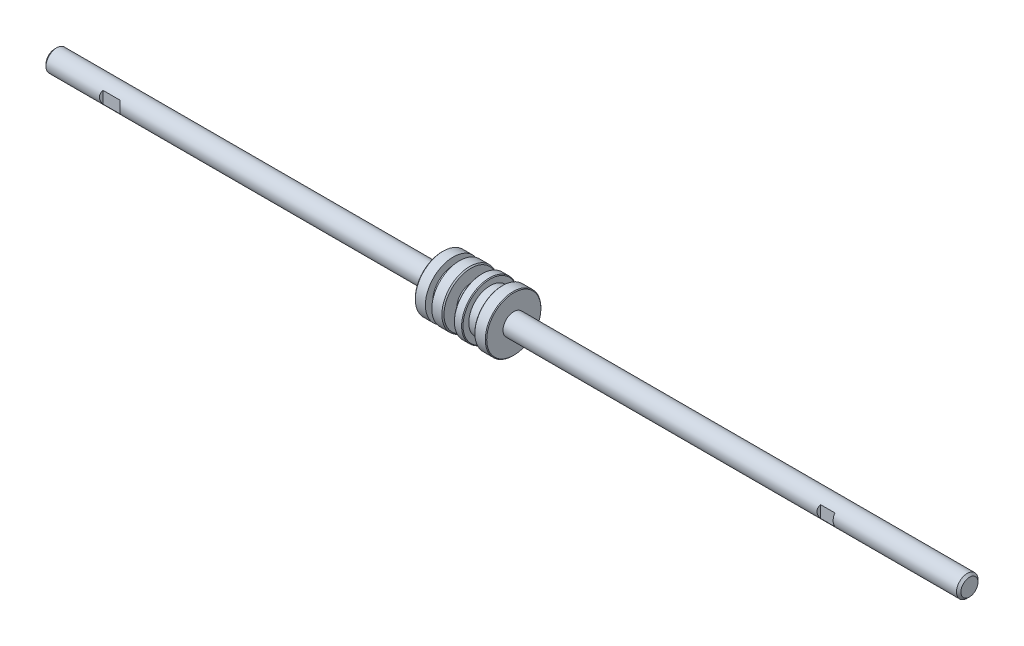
ISO-10303-21;
HEADER;
FILE_DESCRIPTION(('STEP AP214'),'2;1');
FILE_NAME('part.step','',(''),(''),'','','');
FILE_SCHEMA(('AUTOMOTIVE_DESIGN { 1 0 10303 214 1 1 1 1 }'));
ENDSEC;
DATA;
#1=APPLICATION_CONTEXT('core data for automotive mechanical design processes');
#2=APPLICATION_PROTOCOL_DEFINITION('international standard','automotive_design',2000,#1);
#3=PRODUCT_CONTEXT('',#1,'mechanical');
#4=PRODUCT('Part','Part','',(#3));
#5=PRODUCT_RELATED_PRODUCT_CATEGORY('part','',(#4));
#6=PRODUCT_DEFINITION_FORMATION('','',#4);
#7=PRODUCT_DEFINITION_CONTEXT('part definition',#1,'design');
#8=PRODUCT_DEFINITION('design','',#6,#7);
#9=PRODUCT_DEFINITION_SHAPE('','',#8);
#10=(LENGTH_UNIT() NAMED_UNIT(*) SI_UNIT(.MILLI.,.METRE.));
#11=(NAMED_UNIT(*) PLANE_ANGLE_UNIT() SI_UNIT($,.RADIAN.));
#12=(NAMED_UNIT(*) SI_UNIT($,.STERADIAN.) SOLID_ANGLE_UNIT());
#13=UNCERTAINTY_MEASURE_WITH_UNIT(LENGTH_MEASURE(1.E-05),#10,'distance_accuracy_value','');
#14=(GEOMETRIC_REPRESENTATION_CONTEXT(3) GLOBAL_UNCERTAINTY_ASSIGNED_CONTEXT((#13)) GLOBAL_UNIT_ASSIGNED_CONTEXT((#10,
#11,#12)) REPRESENTATION_CONTEXT('',''));
#15=CARTESIAN_POINT('',(0.,0.,0.));
#16=DIRECTION('',(0.,0.,1.));
#17=DIRECTION('',(1.,0.,0.));
#18=AXIS2_PLACEMENT_3D('',#15,#16,#17);
#19=CARTESIAN_POINT('',(0.,0.,0.));
#20=DIRECTION('',(1.,0.,0.));
#21=DIRECTION('',(0.,0.,-1.));
#22=AXIS2_PLACEMENT_3D('',#19,#20,#21);
#23=PLANE('',#22);
#24=CARTESIAN_POINT('',(0.,0.,0.));
#25=DIRECTION('',(1.,0.,0.));
#26=DIRECTION('',(0.,0.,-1.));
#27=AXIS2_PLACEMENT_3D('',#24,#25,#26);
#28=CIRCLE('',#27,2.38649999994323);
#29=CARTESIAN_POINT('',(0.,0.,-2.38649999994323));
#30=VERTEX_POINT('',#29);
#31=EDGE_CURVE('E20',#30,#30,#28,.T.);
#32=ORIENTED_EDGE('',*,*,#31,.F.);
#33=EDGE_LOOP('',(#32));
#34=FACE_BOUND('',#33,.T.);
#35=ADVANCED_FACE('F17',(#34),#23,.F.);
#36=CARTESIAN_POINT('',(20.8,-2.5,-2.5));
#37=DIRECTION('',(0.707106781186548,0.,0.707106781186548));
#38=DIRECTION('',(0.707106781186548,0.,-0.707106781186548));
#39=AXIS2_PLACEMENT_3D('',#36,#37,#38);
#40=PLANE('',#39);
#41=CARTESIAN_POINT('',(18.3,0.,0.));
#42=DIRECTION('',(0.707106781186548,0.,0.707106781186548));
#43=DIRECTION('',(-0.707106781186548,0.,0.707106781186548));
#44=AXIS2_PLACEMENT_3D('',#41,#42,#43);
#45=ELLIPSE('',#44,4.24264068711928,3.);
#46=CARTESIAN_POINT('',(20.8,-1.6583123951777,-2.5));
#47=VERTEX_POINT('',#46);
#48=CARTESIAN_POINT('',(20.8,1.6583123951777,-2.5));
#49=VERTEX_POINT('',#48);
#50=EDGE_CURVE('E105',#47,#49,#45,.T.);
#51=ORIENTED_EDGE('',*,*,#50,.F.);
#52=DIRECTION('',(0.,1.,0.));
#53=VECTOR('',#52,1.);
#54=CARTESIAN_POINT('',(20.8,-2.5,-2.5));
#55=LINE('',#54,#53);
#56=EDGE_CURVE('E116',#47,#49,#55,.T.);
#57=ORIENTED_EDGE('',*,*,#56,.T.);
#58=EDGE_LOOP('',(#51,#57));
#59=FACE_BOUND('',#58,.T.);
#60=ADVANCED_FACE('F368',(#59),#40,.F.);
#61=CARTESIAN_POINT('',(16.,-2.5,-2.5));
#62=DIRECTION('',(0.,0.,1.));
#63=DIRECTION('',(1.,0.,0.));
#64=AXIS2_PLACEMENT_3D('',#61,#62,#63);
#65=PLANE('',#64);
#66=DIRECTION('',(-1.,0.,0.));
#67=VECTOR('',#66,1.);
#68=CARTESIAN_POINT('',(255.,-1.65831239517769,-2.50000000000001));
#69=LINE('',#68,#67);
#70=CARTESIAN_POINT('',(16.,-1.65831239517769,-2.50000000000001));
#71=VERTEX_POINT('',#70);
#72=EDGE_CURVE('E102',#71,#47,#69,.F.);
#73=ORIENTED_EDGE('',*,*,#72,.F.);
#74=DIRECTION('',(0.,1.,0.));
#75=VECTOR('',#74,1.);
#76=CARTESIAN_POINT('',(16.,-2.5,-2.5));
#77=LINE('',#76,#75);
#78=CARTESIAN_POINT('',(16.,1.65831239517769,-2.5));
#79=VERTEX_POINT('',#78);
#80=EDGE_CURVE('E114',#71,#79,#77,.T.);
#81=ORIENTED_EDGE('',*,*,#80,.T.);
#82=DIRECTION('',(-1.,0.,0.));
#83=VECTOR('',#82,1.);
#84=CARTESIAN_POINT('',(255.,1.6583123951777,-2.5));
#85=LINE('',#84,#83);
#86=EDGE_CURVE('E188',#49,#79,#85,.T.);
#87=ORIENTED_EDGE('',*,*,#86,.F.);
#88=ORIENTED_EDGE('',*,*,#56,.F.);
#89=EDGE_LOOP('',(#73,#81,#87,#88));
#90=FACE_BOUND('',#89,.T.);
#91=ADVANCED_FACE('F365',(#90),#65,.F.);
#92=CARTESIAN_POINT('',(14.4,-2.5,-4.1));
#93=DIRECTION('',(-0.707106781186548,0.,0.707106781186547));
#94=DIRECTION('',(0.707106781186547,0.,0.707106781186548));
#95=AXIS2_PLACEMENT_3D('',#92,#93,#94);
#96=PLANE('',#95);
#97=ORIENTED_EDGE('',*,*,#80,.F.);
#98=CARTESIAN_POINT('',(18.5,0.,0.));
#99=DIRECTION('',(-0.707106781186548,0.,0.707106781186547));
#100=DIRECTION('',(-0.707106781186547,0.,-0.707106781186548));
#101=AXIS2_PLACEMENT_3D('',#98,#99,#100);
#102=ELLIPSE('',#101,4.24264068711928,3.);
#103=EDGE_CURVE('E113',#79,#71,#102,.T.);
#104=ORIENTED_EDGE('',*,*,#103,.F.);
#105=EDGE_LOOP('',(#97,#104));
#106=FACE_BOUND('',#105,.T.);
#107=ADVANCED_FACE('F361',(#106),#96,.F.);
#108=CARTESIAN_POINT('',(0.613500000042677,0.,0.));
#109=DIRECTION('',(1.,0.,0.));
#110=DIRECTION('',(0.,0.,-1.));
#111=AXIS2_PLACEMENT_3D('',#108,#109,#110);
#112=CONICAL_SURFACE('',#111,3.00000000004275,0.785398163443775);
#113=CARTESIAN_POINT('',(0.613499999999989,0.,0.));
#114=DIRECTION('',(-1.,0.,0.));
#115=DIRECTION('',(0.,0.,1.));
#116=AXIS2_PLACEMENT_3D('',#113,#114,#115);
#117=CIRCLE('',#116,3.);
#118=CARTESIAN_POINT('',(0.613499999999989,0.,3.));
#119=VERTEX_POINT('',#118);
#120=EDGE_CURVE('E110',#119,#119,#117,.F.);
#121=ORIENTED_EDGE('',*,*,#120,.F.);
#122=EDGE_LOOP('',(#121));
#123=FACE_BOUND('',#122,.T.);
#124=ORIENTED_EDGE('',*,*,#31,.T.);
#125=EDGE_LOOP('',(#124));
#126=FACE_BOUND('',#125,.T.);
#127=ADVANCED_FACE('F358',(#123,#126),#112,.T.);
#128=CARTESIAN_POINT('',(16.,-2.5,2.5));
#129=DIRECTION('',(-0.707106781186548,0.,-0.707106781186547));
#130=DIRECTION('',(-0.707106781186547,0.,0.707106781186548));
#131=AXIS2_PLACEMENT_3D('',#128,#129,#130);
#132=PLANE('',#131);
#133=CARTESIAN_POINT('',(18.5,0.,0.));
#134=DIRECTION('',(-0.707106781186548,0.,-0.707106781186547));
#135=DIRECTION('',(-0.707106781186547,0.,0.707106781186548));
#136=AXIS2_PLACEMENT_3D('',#133,#134,#135);
#137=ELLIPSE('',#136,4.24264068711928,3.);
#138=CARTESIAN_POINT('',(16.,-1.65831239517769,2.5));
#139=VERTEX_POINT('',#138);
#140=CARTESIAN_POINT('',(16.,1.65831239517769,2.5));
#141=VERTEX_POINT('',#140);
#142=EDGE_CURVE('E78',#139,#141,#137,.T.);
#143=ORIENTED_EDGE('',*,*,#142,.F.);
#144=DIRECTION('',(0.,1.,0.));
#145=VECTOR('',#144,1.);
#146=CARTESIAN_POINT('',(16.,-2.5,2.5));
#147=LINE('',#146,#145);
#148=EDGE_CURVE('E99',#139,#141,#147,.T.);
#149=ORIENTED_EDGE('',*,*,#148,.T.);
#150=EDGE_LOOP('',(#143,#149));
#151=FACE_BOUND('',#150,.T.);
#152=ADVANCED_FACE('F355',(#151),#132,.F.);
#153=CARTESIAN_POINT('',(20.8,-2.5,2.5));
#154=DIRECTION('',(0.,0.,-1.));
#155=DIRECTION('',(-1.,0.,0.));
#156=AXIS2_PLACEMENT_3D('',#153,#154,#155);
#157=PLANE('',#156);
#158=DIRECTION('',(-1.,0.,0.));
#159=VECTOR('',#158,1.);
#160=CARTESIAN_POINT('',(255.,1.6583123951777,2.5));
#161=LINE('',#160,#159);
#162=CARTESIAN_POINT('',(20.8,1.65831239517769,2.5));
#163=VERTEX_POINT('',#162);
#164=EDGE_CURVE('E92',#141,#163,#161,.F.);
#165=ORIENTED_EDGE('',*,*,#164,.F.);
#166=ORIENTED_EDGE('',*,*,#148,.F.);
#167=DIRECTION('',(-1.,0.,0.));
#168=VECTOR('',#167,1.);
#169=CARTESIAN_POINT('',(255.,-1.65831239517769,2.50000000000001));
#170=LINE('',#169,#168);
#171=CARTESIAN_POINT('',(20.8,-1.65831239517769,2.5));
#172=VERTEX_POINT('',#171);
#173=EDGE_CURVE('E90',#172,#139,#170,.T.);
#174=ORIENTED_EDGE('',*,*,#173,.F.);
#175=DIRECTION('',(0.,1.,0.));
#176=VECTOR('',#175,1.);
#177=CARTESIAN_POINT('',(20.8,-2.5,2.5));
#178=LINE('',#177,#176);
#179=EDGE_CURVE('E96',#172,#163,#178,.T.);
#180=ORIENTED_EDGE('',*,*,#179,.T.);
#181=EDGE_LOOP('',(#165,#166,#174,#180));
#182=FACE_BOUND('',#181,.T.);
#183=ADVANCED_FACE('F101',(#182),#157,.F.);
#184=CARTESIAN_POINT('',(30.3,-2.5,12.));
#185=DIRECTION('',(0.707106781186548,0.,-0.707106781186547));
#186=DIRECTION('',(-0.707106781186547,0.,-0.707106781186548));
#187=AXIS2_PLACEMENT_3D('',#184,#185,#186);
#188=PLANE('',#187);
#189=ORIENTED_EDGE('',*,*,#179,.F.);
#190=CARTESIAN_POINT('',(18.3,0.,0.));
#191=DIRECTION('',(0.707106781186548,0.,-0.707106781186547));
#192=DIRECTION('',(-0.707106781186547,0.,-0.707106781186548));
#193=AXIS2_PLACEMENT_3D('',#190,#191,#192);
#194=ELLIPSE('',#193,4.24264068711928,3.);
#195=EDGE_CURVE('E85',#163,#172,#194,.T.);
#196=ORIENTED_EDGE('',*,*,#195,.F.);
#197=EDGE_LOOP('',(#189,#196));
#198=FACE_BOUND('',#197,.T.);
#199=ADVANCED_FACE('F97',(#198),#188,.F.);
#200=CARTESIAN_POINT('',(255.,0.,0.));
#201=DIRECTION('',(-1.,0.,0.));
#202=DIRECTION('',(0.,0.,1.));
#203=AXIS2_PLACEMENT_3D('',#200,#201,#202);
#204=CYLINDRICAL_SURFACE('',#203,3.);
#205=ORIENTED_EDGE('',*,*,#72,.T.);
#206=ORIENTED_EDGE('',*,*,#50,.T.);
#207=ORIENTED_EDGE('',*,*,#86,.T.);
#208=ORIENTED_EDGE('',*,*,#103,.T.);
#209=EDGE_LOOP('',(#205,#206,#207,#208));
#210=FACE_BOUND('',#209,.T.);
#211=ORIENTED_EDGE('',*,*,#120,.T.);
#212=EDGE_LOOP('',(#211));
#213=FACE_BOUND('',#212,.T.);
#214=ORIENTED_EDGE('',*,*,#173,.T.);
#215=ORIENTED_EDGE('',*,*,#142,.T.);
#216=ORIENTED_EDGE('',*,*,#164,.T.);
#217=ORIENTED_EDGE('',*,*,#195,.T.);
#218=EDGE_LOOP('',(#214,#215,#216,#217));
#219=FACE_BOUND('',#218,.T.);
#220=CARTESIAN_POINT('',(108.,0.,0.));
#221=DIRECTION('',(-1.,0.,0.));
#222=DIRECTION('',(0.,0.,1.));
#223=AXIS2_PLACEMENT_3D('',#220,#221,#222);
#224=CIRCLE('',#223,3.);
#225=CARTESIAN_POINT('',(108.,0.,3.));
#226=VERTEX_POINT('',#225);
#227=EDGE_CURVE('E94',#226,#226,#224,.T.);
#228=ORIENTED_EDGE('',*,*,#227,.T.);
#229=EDGE_LOOP('',(#228));
#230=FACE_BOUND('',#229,.T.);
#231=ADVANCED_FACE('F87',(#210,#213,#219,#230),#204,.T.);
#232=CARTESIAN_POINT('',(108.,3.,0.));
#233=DIRECTION('',(1.,0.,0.));
#234=DIRECTION('',(0.,0.,-1.));
#235=AXIS2_PLACEMENT_3D('',#232,#233,#234);
#236=PLANE('',#235);
#237=CARTESIAN_POINT('',(108.,0.,0.));
#238=DIRECTION('',(1.,0.,0.));
#239=DIRECTION('',(0.,0.,-1.));
#240=AXIS2_PLACEMENT_3D('',#237,#238,#239);
#241=CIRCLE('',#240,7.45);
#242=CARTESIAN_POINT('',(108.,0.,-7.45));
#243=VERTEX_POINT('',#242);
#244=EDGE_CURVE('E182',#243,#243,#241,.T.);
#245=ORIENTED_EDGE('',*,*,#244,.F.);
#246=EDGE_LOOP('',(#245));
#247=FACE_BOUND('',#246,.T.);
#248=ORIENTED_EDGE('',*,*,#227,.F.);
#249=EDGE_LOOP('',(#248));
#250=FACE_BOUND('',#249,.T.);
#251=ADVANCED_FACE('F344',(#247,#250),#236,.F.);
#252=CARTESIAN_POINT('',(108.3,0.,0.));
#253=DIRECTION('',(1.,0.,0.));
#254=DIRECTION('',(0.,0.,-1.));
#255=AXIS2_PLACEMENT_3D('',#252,#253,#254);
#256=CONICAL_SURFACE('',#255,7.75,0.785398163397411);
#257=CARTESIAN_POINT('',(108.3,0.,0.));
#258=DIRECTION('',(-1.,0.,0.));
#259=DIRECTION('',(0.,0.,1.));
#260=AXIS2_PLACEMENT_3D('',#257,#258,#259);
#261=CIRCLE('',#260,7.75);
#262=CARTESIAN_POINT('',(108.3,0.,7.75));
#263=VERTEX_POINT('',#262);
#264=EDGE_CURVE('E181',#263,#263,#261,.F.);
#265=ORIENTED_EDGE('',*,*,#264,.F.);
#266=EDGE_LOOP('',(#265));
#267=FACE_BOUND('',#266,.T.);
#268=ORIENTED_EDGE('',*,*,#244,.T.);
#269=EDGE_LOOP('',(#268));
#270=FACE_BOUND('',#269,.T.);
#271=ADVANCED_FACE('F340',(#267,#270),#256,.T.);
#272=CARTESIAN_POINT('',(255.,0.,0.));
#273=DIRECTION('',(-1.,0.,0.));
#274=DIRECTION('',(0.,0.,1.));
#275=AXIS2_PLACEMENT_3D('',#272,#273,#274);
#276=CYLINDRICAL_SURFACE('',#275,7.75);
#277=ORIENTED_EDGE('',*,*,#264,.T.);
#278=EDGE_LOOP('',(#277));
#279=FACE_BOUND('',#278,.T.);
#280=CARTESIAN_POINT('',(111.11,0.,0.));
#281=DIRECTION('',(-1.,0.,0.));
#282=DIRECTION('',(0.,0.,1.));
#283=AXIS2_PLACEMENT_3D('',#280,#281,#282);
#284=CIRCLE('',#283,7.75);
#285=CARTESIAN_POINT('',(111.11,0.,7.75));
#286=VERTEX_POINT('',#285);
#287=EDGE_CURVE('E178',#286,#286,#284,.T.);
#288=ORIENTED_EDGE('',*,*,#287,.T.);
#289=EDGE_LOOP('',(#288));
#290=FACE_BOUND('',#289,.T.);
#291=ADVANCED_FACE('F336',(#279,#290),#276,.T.);
#292=CARTESIAN_POINT('',(111.11,7.75,0.));
#293=DIRECTION('',(-1.,0.,0.));
#294=DIRECTION('',(0.,0.,1.));
#295=AXIS2_PLACEMENT_3D('',#292,#293,#294);
#296=PLANE('',#295);
#297=CARTESIAN_POINT('',(111.11,0.,0.));
#298=DIRECTION('',(-1.,0.,0.));
#299=DIRECTION('',(0.,0.,1.));
#300=AXIS2_PLACEMENT_3D('',#297,#298,#299);
#301=CIRCLE('',#300,5.7);
#302=CARTESIAN_POINT('',(111.11,0.,5.7));
#303=VERTEX_POINT('',#302);
#304=EDGE_CURVE('E175',#303,#303,#301,.F.);
#305=ORIENTED_EDGE('',*,*,#304,.F.);
#306=EDGE_LOOP('',(#305));
#307=FACE_BOUND('',#306,.T.);
#308=ORIENTED_EDGE('',*,*,#287,.F.);
#309=EDGE_LOOP('',(#308));
#310=FACE_BOUND('',#309,.T.);
#311=ADVANCED_FACE('F332',(#307,#310),#296,.F.);
#312=CARTESIAN_POINT('',(255.,0.,0.));
#313=DIRECTION('',(-1.,0.,0.));
#314=DIRECTION('',(0.,0.,1.));
#315=AXIS2_PLACEMENT_3D('',#312,#313,#314);
#316=CYLINDRICAL_SURFACE('',#315,5.7);
#317=ORIENTED_EDGE('',*,*,#304,.T.);
#318=EDGE_LOOP('',(#317));
#319=FACE_BOUND('',#318,.T.);
#320=CARTESIAN_POINT('',(112.89,0.,0.));
#321=DIRECTION('',(-1.,0.,0.));
#322=DIRECTION('',(0.,0.,1.));
#323=AXIS2_PLACEMENT_3D('',#320,#321,#322);
#324=CIRCLE('',#323,5.7);
#325=CARTESIAN_POINT('',(112.89,0.,5.7));
#326=VERTEX_POINT('',#325);
#327=EDGE_CURVE('E172',#326,#326,#324,.T.);
#328=ORIENTED_EDGE('',*,*,#327,.T.);
#329=EDGE_LOOP('',(#328));
#330=FACE_BOUND('',#329,.T.);
#331=ADVANCED_FACE('F328',(#319,#330),#316,.T.);
#332=CARTESIAN_POINT('',(112.89,5.7,0.));
#333=DIRECTION('',(1.,0.,0.));
#334=DIRECTION('',(0.,0.,-1.));
#335=AXIS2_PLACEMENT_3D('',#332,#333,#334);
#336=PLANE('',#335);
#337=CARTESIAN_POINT('',(112.89,0.,0.));
#338=DIRECTION('',(-1.,0.,0.));
#339=DIRECTION('',(0.,0.,1.));
#340=AXIS2_PLACEMENT_3D('',#337,#338,#339);
#341=CIRCLE('',#340,7.75);
#342=CARTESIAN_POINT('',(112.89,0.,7.75));
#343=VERTEX_POINT('',#342);
#344=EDGE_CURVE('E169',#343,#343,#341,.F.);
#345=ORIENTED_EDGE('',*,*,#344,.F.);
#346=EDGE_LOOP('',(#345));
#347=FACE_BOUND('',#346,.T.);
#348=ORIENTED_EDGE('',*,*,#327,.F.);
#349=EDGE_LOOP('',(#348));
#350=FACE_BOUND('',#349,.T.);
#351=ADVANCED_FACE('F324',(#347,#350),#336,.F.);
#352=CARTESIAN_POINT('',(255.,0.,0.));
#353=DIRECTION('',(-1.,0.,0.));
#354=DIRECTION('',(0.,0.,1.));
#355=AXIS2_PLACEMENT_3D('',#352,#353,#354);
#356=CYLINDRICAL_SURFACE('',#355,7.75);
#357=ORIENTED_EDGE('',*,*,#344,.T.);
#358=EDGE_LOOP('',(#357));
#359=FACE_BOUND('',#358,.T.);
#360=CARTESIAN_POINT('',(115.7,0.,0.));
#361=DIRECTION('',(-1.,0.,0.));
#362=DIRECTION('',(0.,0.,1.));
#363=AXIS2_PLACEMENT_3D('',#360,#361,#362);
#364=CIRCLE('',#363,7.74999999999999);
#365=CARTESIAN_POINT('',(115.7,0.,7.74999999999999));
#366=VERTEX_POINT('',#365);
#367=EDGE_CURVE('E168',#366,#366,#364,.F.);
#368=ORIENTED_EDGE('',*,*,#367,.F.);
#369=EDGE_LOOP('',(#368));
#370=FACE_BOUND('',#369,.T.);
#371=ADVANCED_FACE('F320',(#359,#370),#356,.T.);
#372=CARTESIAN_POINT('',(115.7,0.,0.));
#373=DIRECTION('',(-1.,0.,0.));
#374=DIRECTION('',(0.,0.,1.));
#375=AXIS2_PLACEMENT_3D('',#372,#373,#374);
#376=CONICAL_SURFACE('',#375,7.74999999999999,0.785398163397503);
#377=ORIENTED_EDGE('',*,*,#367,.T.);
#378=EDGE_LOOP('',(#377));
#379=FACE_BOUND('',#378,.T.);
#380=CARTESIAN_POINT('',(116.,0.,0.));
#381=DIRECTION('',(-1.,0.,0.));
#382=DIRECTION('',(0.,0.,1.));
#383=AXIS2_PLACEMENT_3D('',#380,#381,#382);
#384=CIRCLE('',#383,7.45);
#385=CARTESIAN_POINT('',(116.,0.,7.45));
#386=VERTEX_POINT('',#385);
#387=EDGE_CURVE('E165',#386,#386,#384,.T.);
#388=ORIENTED_EDGE('',*,*,#387,.T.);
#389=EDGE_LOOP('',(#388));
#390=FACE_BOUND('',#389,.T.);
#391=ADVANCED_FACE('F316',(#379,#390),#376,.T.);
#392=CARTESIAN_POINT('',(116.,7.45,0.));
#393=DIRECTION('',(-1.,0.,0.));
#394=DIRECTION('',(0.,0.,1.));
#395=AXIS2_PLACEMENT_3D('',#392,#393,#394);
#396=PLANE('',#395);
#397=CARTESIAN_POINT('',(116.,0.,0.));
#398=DIRECTION('',(-1.,0.,0.));
#399=DIRECTION('',(0.,0.,1.));
#400=AXIS2_PLACEMENT_3D('',#397,#398,#399);
#401=CIRCLE('',#400,3.85);
#402=CARTESIAN_POINT('',(116.,0.,3.85));
#403=VERTEX_POINT('',#402);
#404=EDGE_CURVE('E162',#403,#403,#401,.F.);
#405=ORIENTED_EDGE('',*,*,#404,.F.);
#406=EDGE_LOOP('',(#405));
#407=FACE_BOUND('',#406,.T.);
#408=ORIENTED_EDGE('',*,*,#387,.F.);
#409=EDGE_LOOP('',(#408));
#410=FACE_BOUND('',#409,.T.);
#411=ADVANCED_FACE('F312',(#407,#410),#396,.F.);
#412=CARTESIAN_POINT('',(255.,0.,0.));
#413=DIRECTION('',(-1.,0.,0.));
#414=DIRECTION('',(0.,0.,1.));
#415=AXIS2_PLACEMENT_3D('',#412,#413,#414);
#416=CYLINDRICAL_SURFACE('',#415,3.85);
#417=ORIENTED_EDGE('',*,*,#404,.T.);
#418=EDGE_LOOP('',(#417));
#419=FACE_BOUND('',#418,.T.);
#420=CARTESIAN_POINT('',(119.,0.,0.));
#421=DIRECTION('',(-1.,0.,0.));
#422=DIRECTION('',(0.,0.,1.));
#423=AXIS2_PLACEMENT_3D('',#420,#421,#422);
#424=CIRCLE('',#423,3.85);
#425=CARTESIAN_POINT('',(119.,0.,3.85));
#426=VERTEX_POINT('',#425);
#427=EDGE_CURVE('E159',#426,#426,#424,.T.);
#428=ORIENTED_EDGE('',*,*,#427,.T.);
#429=EDGE_LOOP('',(#428));
#430=FACE_BOUND('',#429,.T.);
#431=ADVANCED_FACE('F308',(#419,#430),#416,.T.);
#432=CARTESIAN_POINT('',(119.,3.85,0.));
#433=DIRECTION('',(1.,0.,0.));
#434=DIRECTION('',(0.,0.,-1.));
#435=AXIS2_PLACEMENT_3D('',#432,#433,#434);
#436=PLANE('',#435);
#437=CARTESIAN_POINT('',(119.,0.,0.));
#438=DIRECTION('',(1.,0.,0.));
#439=DIRECTION('',(0.,1.,0.));
#440=AXIS2_PLACEMENT_3D('',#437,#438,#439);
#441=CIRCLE('',#440,7.55);
#442=CARTESIAN_POINT('',(119.,7.55,0.));
#443=VERTEX_POINT('',#442);
#444=EDGE_CURVE('E155',#443,#443,#441,.T.);
#445=ORIENTED_EDGE('',*,*,#444,.F.);
#446=EDGE_LOOP('',(#445));
#447=FACE_BOUND('',#446,.T.);
#448=ORIENTED_EDGE('',*,*,#427,.F.);
#449=EDGE_LOOP('',(#448));
#450=FACE_BOUND('',#449,.T.);
#451=ADVANCED_FACE('F304',(#447,#450),#436,.F.);
#452=CARTESIAN_POINT('',(119.2,0.,0.));
#453=DIRECTION('',(1.,0.,0.));
#454=DIRECTION('',(0.,1.,0.));
#455=AXIS2_PLACEMENT_3D('',#452,#453,#454);
#456=CONICAL_SURFACE('',#455,7.75,0.785398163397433);
#457=CARTESIAN_POINT('',(119.2,0.,0.));
#458=DIRECTION('',(-1.,0.,0.));
#459=DIRECTION('',(0.,0.,1.));
#460=AXIS2_PLACEMENT_3D('',#457,#458,#459);
#461=CIRCLE('',#460,7.75);
#462=CARTESIAN_POINT('',(119.2,0.,7.75));
#463=VERTEX_POINT('',#462);
#464=EDGE_CURVE('E158',#463,#463,#461,.F.);
#465=ORIENTED_EDGE('',*,*,#464,.F.);
#466=EDGE_LOOP('',(#465));
#467=FACE_BOUND('',#466,.T.);
#468=ORIENTED_EDGE('',*,*,#444,.T.);
#469=EDGE_LOOP('',(#468));
#470=FACE_BOUND('',#469,.T.);
#471=ADVANCED_FACE('F300',(#467,#470),#456,.T.);
#472=CARTESIAN_POINT('',(255.,0.,0.));
#473=DIRECTION('',(-1.,0.,0.));
#474=DIRECTION('',(0.,0.,1.));
#475=AXIS2_PLACEMENT_3D('',#472,#473,#474);
#476=CYLINDRICAL_SURFACE('',#475,7.75);
#477=ORIENTED_EDGE('',*,*,#464,.T.);
#478=EDGE_LOOP('',(#477));
#479=FACE_BOUND('',#478,.T.);
#480=CARTESIAN_POINT('',(121.2,0.,0.));
#481=DIRECTION('',(-1.,0.,0.));
#482=DIRECTION('',(0.,0.,1.));
#483=AXIS2_PLACEMENT_3D('',#480,#481,#482);
#484=CIRCLE('',#483,7.75);
#485=CARTESIAN_POINT('',(121.2,0.,7.75));
#486=VERTEX_POINT('',#485);
#487=EDGE_CURVE('E154',#486,#486,#484,.F.);
#488=ORIENTED_EDGE('',*,*,#487,.F.);
#489=EDGE_LOOP('',(#488));
#490=FACE_BOUND('',#489,.T.);
#491=ADVANCED_FACE('F296',(#479,#490),#476,.T.);
#492=CARTESIAN_POINT('',(121.2,0.,0.));
#493=DIRECTION('',(-1.,0.,0.));
#494=DIRECTION('',(0.,0.,1.));
#495=AXIS2_PLACEMENT_3D('',#492,#493,#494);
#496=CONICAL_SURFACE('',#495,7.75,0.785398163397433);
#497=ORIENTED_EDGE('',*,*,#487,.T.);
#498=EDGE_LOOP('',(#497));
#499=FACE_BOUND('',#498,.T.);
#500=CARTESIAN_POINT('',(121.4,0.,0.));
#501=DIRECTION('',(-1.,0.,0.));
#502=DIRECTION('',(0.,0.,1.));
#503=AXIS2_PLACEMENT_3D('',#500,#501,#502);
#504=CIRCLE('',#503,7.55);
#505=CARTESIAN_POINT('',(121.4,0.,7.55));
#506=VERTEX_POINT('',#505);
#507=EDGE_CURVE('E151',#506,#506,#504,.T.);
#508=ORIENTED_EDGE('',*,*,#507,.T.);
#509=EDGE_LOOP('',(#508));
#510=FACE_BOUND('',#509,.T.);
#511=ADVANCED_FACE('F292',(#499,#510),#496,.T.);
#512=CARTESIAN_POINT('',(121.4,7.55,0.));
#513=DIRECTION('',(-1.,0.,0.));
#514=DIRECTION('',(0.,0.,1.));
#515=AXIS2_PLACEMENT_3D('',#512,#513,#514);
#516=PLANE('',#515);
#517=CARTESIAN_POINT('',(121.4,0.,0.));
#518=DIRECTION('',(-1.,0.,0.));
#519=DIRECTION('',(0.,0.,1.));
#520=AXIS2_PLACEMENT_3D('',#517,#518,#519);
#521=CIRCLE('',#520,5.95);
#522=CARTESIAN_POINT('',(121.4,0.,5.95));
#523=VERTEX_POINT('',#522);
#524=EDGE_CURVE('E148',#523,#523,#521,.F.);
#525=ORIENTED_EDGE('',*,*,#524,.F.);
#526=EDGE_LOOP('',(#525));
#527=FACE_BOUND('',#526,.T.);
#528=ORIENTED_EDGE('',*,*,#507,.F.);
#529=EDGE_LOOP('',(#528));
#530=FACE_BOUND('',#529,.T.);
#531=ADVANCED_FACE('F288',(#527,#530),#516,.F.);
#532=CARTESIAN_POINT('',(255.,0.,0.));
#533=DIRECTION('',(-1.,0.,0.));
#534=DIRECTION('',(0.,0.,1.));
#535=AXIS2_PLACEMENT_3D('',#532,#533,#534);
#536=CYLINDRICAL_SURFACE('',#535,5.95);
#537=ORIENTED_EDGE('',*,*,#524,.T.);
#538=EDGE_LOOP('',(#537));
#539=FACE_BOUND('',#538,.T.);
#540=CARTESIAN_POINT('',(124.7,0.,0.));
#541=DIRECTION('',(-1.,0.,0.));
#542=DIRECTION('',(0.,0.,1.));
#543=AXIS2_PLACEMENT_3D('',#540,#541,#542);
#544=CIRCLE('',#543,5.95);
#545=CARTESIAN_POINT('',(124.7,0.,5.95));
#546=VERTEX_POINT('',#545);
#547=EDGE_CURVE('E145',#546,#546,#544,.T.);
#548=ORIENTED_EDGE('',*,*,#547,.T.);
#549=EDGE_LOOP('',(#548));
#550=FACE_BOUND('',#549,.T.);
#551=ADVANCED_FACE('F284',(#539,#550),#536,.T.);
#552=CARTESIAN_POINT('',(124.7,5.95,0.));
#553=DIRECTION('',(1.,0.,0.));
#554=DIRECTION('',(0.,0.,-1.));
#555=AXIS2_PLACEMENT_3D('',#552,#553,#554);
#556=PLANE('',#555);
#557=CARTESIAN_POINT('',(124.7,0.,0.));
#558=DIRECTION('',(1.,0.,0.));
#559=DIRECTION('',(0.,0.,-1.));
#560=AXIS2_PLACEMENT_3D('',#557,#558,#559);
#561=CIRCLE('',#560,7.55);
#562=CARTESIAN_POINT('',(124.7,0.,-7.55));
#563=VERTEX_POINT('',#562);
#564=EDGE_CURVE('E141',#563,#563,#561,.T.);
#565=ORIENTED_EDGE('',*,*,#564,.F.);
#566=EDGE_LOOP('',(#565));
#567=FACE_BOUND('',#566,.T.);
#568=ORIENTED_EDGE('',*,*,#547,.F.);
#569=EDGE_LOOP('',(#568));
#570=FACE_BOUND('',#569,.T.);
#571=ADVANCED_FACE('F280',(#567,#570),#556,.F.);
#572=CARTESIAN_POINT('',(124.9,0.,0.));
#573=DIRECTION('',(1.,0.,0.));
#574=DIRECTION('',(0.,0.,-1.));
#575=AXIS2_PLACEMENT_3D('',#572,#573,#574);
#576=CONICAL_SURFACE('',#575,7.75,0.785398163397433);
#577=CARTESIAN_POINT('',(124.9,0.,0.));
#578=DIRECTION('',(-1.,0.,0.));
#579=DIRECTION('',(0.,0.,1.));
#580=AXIS2_PLACEMENT_3D('',#577,#578,#579);
#581=CIRCLE('',#580,7.75);
#582=CARTESIAN_POINT('',(124.9,0.,7.75));
#583=VERTEX_POINT('',#582);
#584=EDGE_CURVE('E144',#583,#583,#581,.F.);
#585=ORIENTED_EDGE('',*,*,#584,.F.);
#586=EDGE_LOOP('',(#585));
#587=FACE_BOUND('',#586,.T.);
#588=ORIENTED_EDGE('',*,*,#564,.T.);
#589=EDGE_LOOP('',(#588));
#590=FACE_BOUND('',#589,.T.);
#591=ADVANCED_FACE('F276',(#587,#590),#576,.T.);
#592=CARTESIAN_POINT('',(255.,0.,0.));
#593=DIRECTION('',(-1.,0.,0.));
#594=DIRECTION('',(0.,0.,1.));
#595=AXIS2_PLACEMENT_3D('',#592,#593,#594);
#596=CYLINDRICAL_SURFACE('',#595,7.75);
#597=ORIENTED_EDGE('',*,*,#584,.T.);
#598=EDGE_LOOP('',(#597));
#599=FACE_BOUND('',#598,.T.);
#600=CARTESIAN_POINT('',(127.8,0.,0.));
#601=DIRECTION('',(-1.,0.,0.));
#602=DIRECTION('',(0.,0.,1.));
#603=AXIS2_PLACEMENT_3D('',#600,#601,#602);
#604=CIRCLE('',#603,7.75);
#605=CARTESIAN_POINT('',(127.8,0.,7.75));
#606=VERTEX_POINT('',#605);
#607=EDGE_CURVE('E140',#606,#606,#604,.F.);
#608=ORIENTED_EDGE('',*,*,#607,.F.);
#609=EDGE_LOOP('',(#608));
#610=FACE_BOUND('',#609,.T.);
#611=ADVANCED_FACE('F269',(#599,#610),#596,.T.);
#612=CARTESIAN_POINT('',(255.,2.3865,0.));
#613=DIRECTION('',(-1.,0.,0.));
#614=DIRECTION('',(0.,0.,1.));
#615=AXIS2_PLACEMENT_3D('',#612,#613,#614);
#616=PLANE('',#615);
#617=CARTESIAN_POINT('',(255.000000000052,0.,0.));
#618=DIRECTION('',(-1.,0.,0.));
#619=DIRECTION('',(0.,0.,1.));
#620=AXIS2_PLACEMENT_3D('',#617,#618,#619);
#621=CIRCLE('',#620,2.38649999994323);
#622=CARTESIAN_POINT('',(255.000000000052,0.,2.38649999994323));
#623=VERTEX_POINT('',#622);
#624=EDGE_CURVE('E136',#623,#623,#621,.T.);
#625=ORIENTED_EDGE('',*,*,#624,.F.);
#626=EDGE_LOOP('',(#625));
#627=FACE_BOUND('',#626,.T.);
#628=ADVANCED_FACE('F259',(#627),#616,.F.);
#629=CARTESIAN_POINT('',(127.8,0.,0.));
#630=DIRECTION('',(-1.,0.,0.));
#631=DIRECTION('',(0.,0.,1.));
#632=AXIS2_PLACEMENT_3D('',#629,#630,#631);
#633=CONICAL_SURFACE('',#632,7.75,0.785398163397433);
#634=ORIENTED_EDGE('',*,*,#607,.T.);
#635=EDGE_LOOP('',(#634));
#636=FACE_BOUND('',#635,.T.);
#637=CARTESIAN_POINT('',(128.,0.,0.));
#638=DIRECTION('',(-1.,0.,0.));
#639=DIRECTION('',(0.,0.,1.));
#640=AXIS2_PLACEMENT_3D('',#637,#638,#639);
#641=CIRCLE('',#640,7.55);
#642=CARTESIAN_POINT('',(128.,0.,7.55));
#643=VERTEX_POINT('',#642);
#644=EDGE_CURVE('E131',#643,#643,#641,.T.);
#645=ORIENTED_EDGE('',*,*,#644,.T.);
#646=EDGE_LOOP('',(#645));
#647=FACE_BOUND('',#646,.T.);
#648=ADVANCED_FACE('F256',(#636,#647),#633,.T.);
#649=CARTESIAN_POINT('',(254.38650000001,0.,0.));
#650=DIRECTION('',(-1.,0.,0.));
#651=DIRECTION('',(0.,0.,1.));
#652=AXIS2_PLACEMENT_3D('',#649,#650,#651);
#653=CONICAL_SURFACE('',#652,2.9999999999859,0.785398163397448);
#654=CARTESIAN_POINT('',(254.3865,0.,0.));
#655=DIRECTION('',(-1.,0.,0.));
#656=DIRECTION('',(0.,0.,1.));
#657=AXIS2_PLACEMENT_3D('',#654,#655,#656);
#658=CIRCLE('',#657,3.);
#659=CARTESIAN_POINT('',(254.3865,0.,3.));
#660=VERTEX_POINT('',#659);
#661=EDGE_CURVE('E130',#660,#660,#658,.T.);
#662=ORIENTED_EDGE('',*,*,#661,.F.);
#663=EDGE_LOOP('',(#662));
#664=FACE_BOUND('',#663,.T.);
#665=ORIENTED_EDGE('',*,*,#624,.T.);
#666=EDGE_LOOP('',(#665));
#667=FACE_BOUND('',#666,.T.);
#668=ADVANCED_FACE('F258',(#664,#667),#653,.T.);
#669=CARTESIAN_POINT('',(220.,-2.5,-2.5));
#670=DIRECTION('',(1.,0.,0.));
#671=DIRECTION('',(0.,0.,-1.));
#672=AXIS2_PLACEMENT_3D('',#669,#670,#671);
#673=PLANE('',#672);
#674=CARTESIAN_POINT('',(220.,0.,0.));
#675=DIRECTION('',(-1.,0.,0.));
#676=DIRECTION('',(0.,0.,1.));
#677=AXIS2_PLACEMENT_3D('',#674,#675,#676);
#678=CIRCLE('',#677,3.);
#679=CARTESIAN_POINT('',(220.,-1.6583123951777,-2.5));
#680=VERTEX_POINT('',#679);
#681=CARTESIAN_POINT('',(220.,1.6583123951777,-2.5));
#682=VERTEX_POINT('',#681);
#683=EDGE_CURVE('E127',#680,#682,#678,.F.);
#684=ORIENTED_EDGE('',*,*,#683,.F.);
#685=DIRECTION('',(0.,1.,0.));
#686=VECTOR('',#685,1.);
#687=CARTESIAN_POINT('',(220.,-2.5,-2.5));
#688=LINE('',#687,#686);
#689=EDGE_CURVE('E139',#680,#682,#688,.T.);
#690=ORIENTED_EDGE('',*,*,#689,.T.);
#691=EDGE_LOOP('',(#684,#690));
#692=FACE_BOUND('',#691,.T.);
#693=ADVANCED_FACE('F266',(#692),#673,.F.);
#694=CARTESIAN_POINT('',(216.,-2.5,-2.5));
#695=DIRECTION('',(0.,0.,1.));
#696=DIRECTION('',(1.,0.,0.));
#697=AXIS2_PLACEMENT_3D('',#694,#695,#696);
#698=PLANE('',#697);
#699=DIRECTION('',(-1.,0.,0.));
#700=VECTOR('',#699,1.);
#701=CARTESIAN_POINT('',(255.,-1.6583123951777,-2.5));
#702=LINE('',#701,#700);
#703=CARTESIAN_POINT('',(216.,-1.65831239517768,-2.50000000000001));
#704=VERTEX_POINT('',#703);
#705=EDGE_CURVE('E209',#704,#680,#702,.F.);
#706=ORIENTED_EDGE('',*,*,#705,.F.);
#707=DIRECTION('',(0.,1.,0.));
#708=VECTOR('',#707,1.);
#709=CARTESIAN_POINT('',(216.,-2.5,-2.50000000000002));
#710=LINE('',#709,#708);
#711=CARTESIAN_POINT('',(216.,1.65831239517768,-2.50000000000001));
#712=VERTEX_POINT('',#711);
#713=EDGE_CURVE('E135',#704,#712,#710,.T.);
#714=ORIENTED_EDGE('',*,*,#713,.T.);
#715=DIRECTION('',(-1.,0.,0.));
#716=VECTOR('',#715,1.);
#717=CARTESIAN_POINT('',(255.,1.6583123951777,-2.5));
#718=LINE('',#717,#716);
#719=EDGE_CURVE('E126',#682,#712,#718,.T.);
#720=ORIENTED_EDGE('',*,*,#719,.F.);
#721=ORIENTED_EDGE('',*,*,#689,.F.);
#722=EDGE_LOOP('',(#706,#714,#720,#721));
#723=FACE_BOUND('',#722,.T.);
#724=ADVANCED_FACE('F579',(#723),#698,.F.);
#725=CARTESIAN_POINT('',(206.5,-2.5,-12.));
#726=DIRECTION('',(-0.707106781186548,0.,0.707106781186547));
#727=DIRECTION('',(0.707106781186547,0.,0.707106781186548));
#728=AXIS2_PLACEMENT_3D('',#725,#726,#727);
#729=PLANE('',#728);
#730=ORIENTED_EDGE('',*,*,#713,.F.);
#731=CARTESIAN_POINT('',(218.5,0.,0.));
#732=DIRECTION('',(-0.707106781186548,0.,0.707106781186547));
#733=DIRECTION('',(-0.707106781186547,0.,-0.707106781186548));
#734=AXIS2_PLACEMENT_3D('',#731,#732,#733);
#735=ELLIPSE('',#734,4.24264068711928,3.);
#736=EDGE_CURVE('E124',#712,#704,#735,.T.);
#737=ORIENTED_EDGE('',*,*,#736,.F.);
#738=EDGE_LOOP('',(#730,#737));
#739=FACE_BOUND('',#738,.T.);
#740=ADVANCED_FACE('F239',(#739),#729,.F.);
#741=CARTESIAN_POINT('',(128.,7.55,0.));
#742=DIRECTION('',(-1.,0.,0.));
#743=DIRECTION('',(0.,0.,1.));
#744=AXIS2_PLACEMENT_3D('',#741,#742,#743);
#745=PLANE('',#744);
#746=CARTESIAN_POINT('',(128.,0.,0.));
#747=DIRECTION('',(-1.,0.,0.));
#748=DIRECTION('',(0.,0.,1.));
#749=AXIS2_PLACEMENT_3D('',#746,#747,#748);
#750=CIRCLE('',#749,3.);
#751=CARTESIAN_POINT('',(128.,0.,3.));
#752=VERTEX_POINT('',#751);
#753=EDGE_CURVE('E121',#752,#752,#750,.F.);
#754=ORIENTED_EDGE('',*,*,#753,.F.);
#755=EDGE_LOOP('',(#754));
#756=FACE_BOUND('',#755,.T.);
#757=ORIENTED_EDGE('',*,*,#644,.F.);
#758=EDGE_LOOP('',(#757));
#759=FACE_BOUND('',#758,.T.);
#760=ADVANCED_FACE('F230',(#756,#759),#745,.F.);
#761=CARTESIAN_POINT('',(216.,-2.5,2.5));
#762=DIRECTION('',(-0.707106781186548,0.,-0.707106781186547));
#763=DIRECTION('',(-0.707106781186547,0.,0.707106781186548));
#764=AXIS2_PLACEMENT_3D('',#761,#762,#763);
#765=PLANE('',#764);
#766=CARTESIAN_POINT('',(218.5,0.,0.));
#767=DIRECTION('',(-0.707106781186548,0.,-0.707106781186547));
#768=DIRECTION('',(-0.707106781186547,0.,0.707106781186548));
#769=AXIS2_PLACEMENT_3D('',#766,#767,#768);
#770=ELLIPSE('',#769,4.24264068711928,3.);
#771=CARTESIAN_POINT('',(216.,-1.6583123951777,2.5));
#772=VERTEX_POINT('',#771);
#773=CARTESIAN_POINT('',(216.,1.6583123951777,2.5));
#774=VERTEX_POINT('',#773);
#775=EDGE_CURVE('E118',#772,#774,#770,.T.);
#776=ORIENTED_EDGE('',*,*,#775,.F.);
#777=DIRECTION('',(0.,1.,0.));
#778=VECTOR('',#777,1.);
#779=CARTESIAN_POINT('',(216.,-2.5,2.5));
#780=LINE('',#779,#778);
#781=EDGE_CURVE('E134',#772,#774,#780,.T.);
#782=ORIENTED_EDGE('',*,*,#781,.T.);
#783=EDGE_LOOP('',(#776,#782));
#784=FACE_BOUND('',#783,.T.);
#785=ADVANCED_FACE('F228',(#784),#765,.F.);
#786=CARTESIAN_POINT('',(220.,-2.5,2.5));
#787=DIRECTION('',(0.,0.,-1.));
#788=DIRECTION('',(-1.,0.,0.));
#789=AXIS2_PLACEMENT_3D('',#786,#787,#788);
#790=PLANE('',#789);
#791=DIRECTION('',(-1.,0.,0.));
#792=VECTOR('',#791,1.);
#793=CARTESIAN_POINT('',(255.,1.6583123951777,2.5));
#794=LINE('',#793,#792);
#795=CARTESIAN_POINT('',(220.,1.6583123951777,2.5));
#796=VERTEX_POINT('',#795);
#797=EDGE_CURVE('E26',#774,#796,#794,.F.);
#798=ORIENTED_EDGE('',*,*,#797,.F.);
#799=ORIENTED_EDGE('',*,*,#781,.F.);
#800=DIRECTION('',(-1.,0.,0.));
#801=VECTOR('',#800,1.);
#802=CARTESIAN_POINT('',(255.,-1.6583123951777,2.5));
#803=LINE('',#802,#801);
#804=CARTESIAN_POINT('',(220.,-1.6583123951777,2.5));
#805=VERTEX_POINT('',#804);
#806=EDGE_CURVE('E214',#805,#772,#803,.T.);
#807=ORIENTED_EDGE('',*,*,#806,.F.);
#808=DIRECTION('',(0.,1.,0.));
#809=VECTOR('',#808,1.);
#810=CARTESIAN_POINT('',(220.,-2.5,2.5));
#811=LINE('',#810,#809);
#812=EDGE_CURVE('E35',#805,#796,#811,.T.);
#813=ORIENTED_EDGE('',*,*,#812,.T.);
#814=EDGE_LOOP('',(#798,#799,#807,#813));
#815=FACE_BOUND('',#814,.T.);
#816=ADVANCED_FACE('F226',(#815),#790,.F.);
#817=CARTESIAN_POINT('',(220.,-2.5,10.));
#818=DIRECTION('',(1.,0.,0.));
#819=DIRECTION('',(0.,0.,-1.));
#820=AXIS2_PLACEMENT_3D('',#817,#818,#819);
#821=PLANE('',#820);
#822=ORIENTED_EDGE('',*,*,#812,.F.);
#823=CARTESIAN_POINT('',(220.,0.,0.));
#824=DIRECTION('',(-1.,0.,0.));
#825=DIRECTION('',(0.,0.,1.));
#826=AXIS2_PLACEMENT_3D('',#823,#824,#825);
#827=CIRCLE('',#826,3.);
#828=EDGE_CURVE('E11',#796,#805,#827,.F.);
#829=ORIENTED_EDGE('',*,*,#828,.F.);
#830=EDGE_LOOP('',(#822,#829));
#831=FACE_BOUND('',#830,.T.);
#832=ADVANCED_FACE('F237',(#831),#821,.F.);
#833=CARTESIAN_POINT('',(255.,0.,0.));
#834=DIRECTION('',(-1.,0.,0.));
#835=DIRECTION('',(0.,0.,1.));
#836=AXIS2_PLACEMENT_3D('',#833,#834,#835);
#837=CYLINDRICAL_SURFACE('',#836,3.);
#838=ORIENTED_EDGE('',*,*,#705,.T.);
#839=ORIENTED_EDGE('',*,*,#683,.T.);
#840=ORIENTED_EDGE('',*,*,#719,.T.);
#841=ORIENTED_EDGE('',*,*,#736,.T.);
#842=EDGE_LOOP('',(#838,#839,#840,#841));
#843=FACE_BOUND('',#842,.T.);
#844=ORIENTED_EDGE('',*,*,#753,.T.);
#845=EDGE_LOOP('',(#844));
#846=FACE_BOUND('',#845,.T.);
#847=ORIENTED_EDGE('',*,*,#806,.T.);
#848=ORIENTED_EDGE('',*,*,#775,.T.);
#849=ORIENTED_EDGE('',*,*,#797,.T.);
#850=ORIENTED_EDGE('',*,*,#828,.T.);
#851=EDGE_LOOP('',(#847,#848,#849,#850));
#852=FACE_BOUND('',#851,.T.);
#853=ORIENTED_EDGE('',*,*,#661,.T.);
#854=EDGE_LOOP('',(#853));
#855=FACE_BOUND('',#854,.T.);
#856=ADVANCED_FACE('F223',(#843,#846,#852,#855),#837,.T.);
#857=CLOSED_SHELL('',(#35,#60,#91,#107,#127,#152,#183,#199,#231,#251,#271,#291,#311,#331,#351,
#371,#391,#411,#431,#451,#471,#491,#511,#531,#551,#571,#591,#611,#628,#648,#668,#693,#724,#740,
#760,#785,#816,#832,#856));
#858=MANIFOLD_SOLID_BREP('B1',#857);
#859=ADVANCED_BREP_SHAPE_REPRESENTATION('',(#18,#858),#14);
#860=SHAPE_DEFINITION_REPRESENTATION(#9,#859);
ENDSEC;
END-ISO-10303-21;
